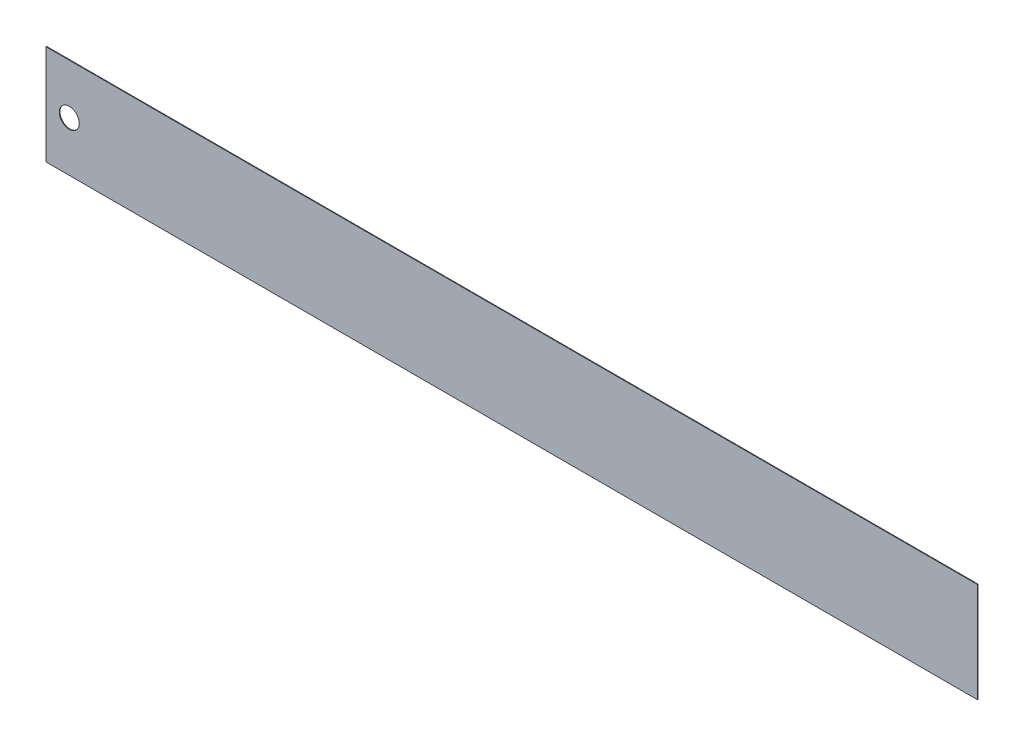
from build123d import *

# Parameters (mm, degrees)
SKETCH1_W           = 140
SKETCH1_H           = 15
SKETCH1_R           = 1.5
BOSS_EXTRUDE2_DEPTH = 0.1


with BuildPart() as part:
    # Sketch1 → Boss-Extrude2 (new body)
    with BuildSketch(Plane.XY):
        with Locations((-1.518392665, 16.619795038)):
            Rectangle(SKETCH1_W, SKETCH1_H)
        with Locations((-68.018392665, 16.619795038)):
            Circle(SKETCH1_R, mode=Mode.SUBTRACT)
    extrude(amount=BOSS_EXTRUDE2_DEPTH)


solid = part.part
